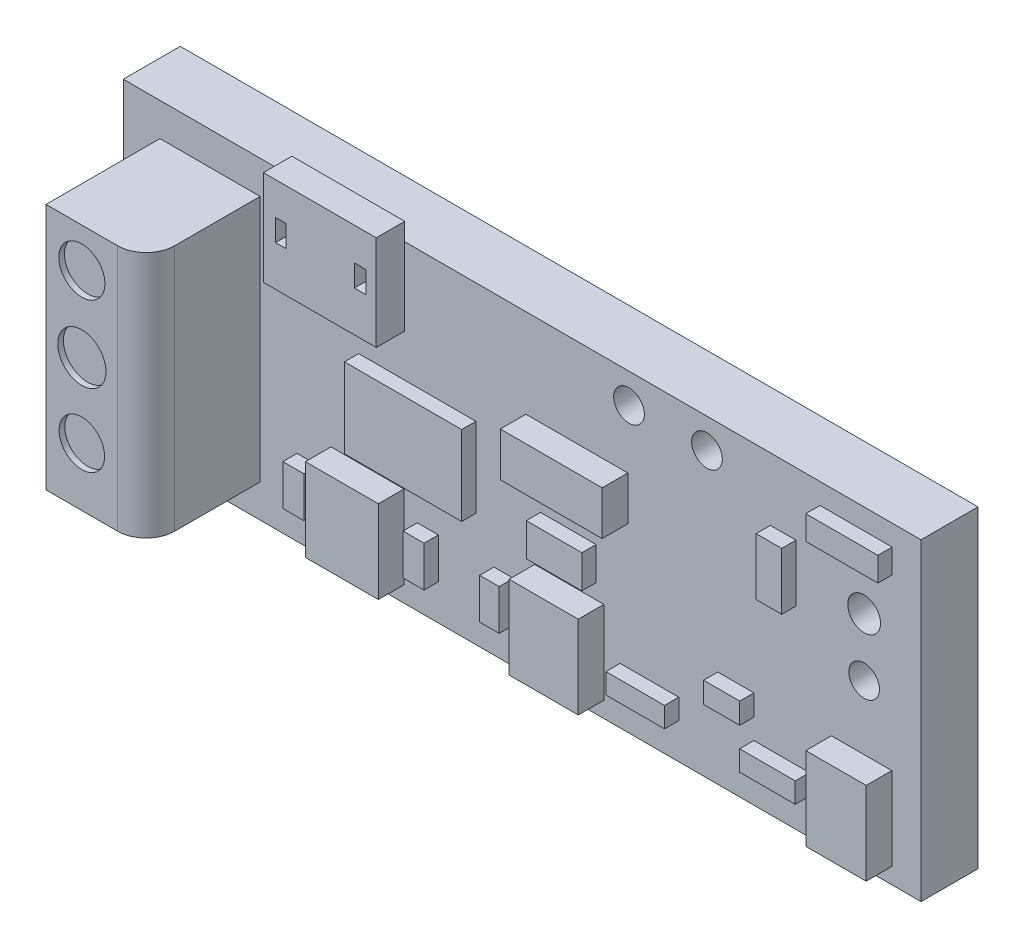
from build123d import *

# Parameters (mm, degrees)
SKETCH_1_W          = 2.8
SKETCH_1_H          = 1.1
EXTRUDE_1_DEPTH     = 0.2
SKETCH_2_W          = 0.351538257
SKETCH_2_H          = 0.867831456
EXTRUDE_2_DEPTH     = 0.4
FILLET_2_R          = 0.1
SKETCH_3_W          = 0.396057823
SKETCH_3_H          = 0.333522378
EXTRUDE_3_DEPTH     = 0.1
SKETCH_4_W          = 0.036503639
SKETCH_4_H          = 0.076483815
SKETCH_4_W_2        = 0.041718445
CUT_EXTRUDE_1_DEPTH = 0.05
SKETCH_5_W          = 0.073840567
SKETCH_5_H          = 0.142406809
SKETCH_5_W_2        = 0.073840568
SKETCH_5_W_3        = 0.068566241
SKETCH_5_W_4        = 0.205698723
SKETCH_5_H_2        = 0.071203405
SKETCH_5_W_5        = 0.195150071
SKETCH_5_W_6        = 0.126583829
SKETCH_5_H_3        = 0.073840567
SKETCH_5_W_7        = 0.089663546
SKETCH_5_H_4        = 0.200424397
SKETCH_5_W_8        = 0.25316766
SKETCH_5_H_5        = 0.08438922
SKETCH_5_H_6        = 0.116035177
SKETCH_5_W_9        = 0.411397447
SKETCH_5_H_7        = 0.279539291
EXTRUDE_4_DEPTH     = 0.05
SKETCH_6_W          = 0.255949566
SKETCH_6_H          = 0.291252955
SKETCH_6_W_2        = 0.242710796
SKETCH_6_W_3        = 0.211820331
SKETCH_6_W_4        = 0.357446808
SKETCH_6_H_2        = 0.154452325
EXTRUDE_5_DEPTH     = 0.09
SKETCH_7_R          = 0.053866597
SKETCH_7_R_2        = 0.057537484
CUT_EXTRUDE_2_DEPTH = 0.2
SKETCH_8_R          = 0.080990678
SKETCH_8_R_2        = 0.084635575
SKETCH_8_R_3        = 0.079956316
CUT_EXTRUDE_3_DEPTH = 0.02


with BuildPart() as part:
    # Sketch 1 → Extrude 1 (new body)
    with BuildSketch(Plane.XY):
        with Locations((-15.251559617, 33.115856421)):
            Rectangle(SKETCH_1_W, SKETCH_1_H)
    extrude(amount=EXTRUDE_1_DEPTH)

    # Sketch 2 → Extrude 2 (add)
    with BuildSketch(Plane.XY.offset(0.2)):
        with Locations((-16.347045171, 33.115856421)):
            Rectangle(SKETCH_2_W, SKETCH_2_H)
    extrude(amount=EXTRUDE_2_DEPTH)

    # Fillet 2
    fillet_2_edges = [part.edges().sort_by_distance(p)[0] for p in [
        (-16.171276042, 33.115856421, 0.6),
    ]]
    fillet(fillet_2_edges, radius=FILLET_2_R)

    # Sketch 3 → Extrude 3 (add)
    with BuildSketch(Plane.XY.offset(0.2)):
        with Locations((-15.861721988, 33.561094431)):
            Rectangle(SKETCH_3_W, SKETCH_3_H)
    extrude(amount=EXTRUDE_3_DEPTH)

    # Sketch 4 → Cut-Extrude 1 (cut)
    with BuildSketch(Plane.XY.offset(0.3)):
        with Locations((-15.998702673, 33.574781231)):
            Rectangle(SKETCH_4_W, SKETCH_4_H)
        with Locations((-15.719710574, 33.574781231)):
            Rectangle(SKETCH_4_W_2, SKETCH_4_H)
    extrude(amount=-CUT_EXTRUDE_1_DEPTH, mode=Mode.SUBTRACT)

    # Sketch 5 → Extrude 4 (add)
    with BuildSketch(Plane.XY.offset(0.2)):
        with Locations((-16.004636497, 32.762275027)):
            Rectangle(SKETCH_5_W, SKETCH_5_H)
        with Locations((-15.582690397, 32.762275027)):
            Rectangle(SKETCH_5_W_2, SKETCH_5_H)
        with Locations((-15.316336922, 32.762275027)):
            Rectangle(SKETCH_5_W_3, SKETCH_5_H)
        with Locations((-14.804727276, 32.726673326)):
            Rectangle(SKETCH_5_W_4, SKETCH_5_H_2)
        with Locations((-14.340586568, 32.726673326)):
            Rectangle(SKETCH_5_W_5, SKETCH_5_H_2)
        with Locations((-14.501453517, 32.870398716)):
            Rectangle(SKETCH_5_W_6, SKETCH_5_H_3)
        with Locations((-14.335312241, 33.345088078)):
            Rectangle(SKETCH_5_W_7, SKETCH_5_H_4)
        with Locations((-14.079507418, 33.550786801)):
            Rectangle(SKETCH_5_W_8, SKETCH_5_H_5)
        with Locations((-15.089540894, 33.023354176)):
            Rectangle(SKETCH_5_W_5, SKETCH_5_H_6)
        with Locations((-15.619610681, 33.105106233)):
            Rectangle(SKETCH_5_W_9, SKETCH_5_H_7)
    extrude(amount=EXTRUDE_4_DEPTH)

    # Sketch 6 → Extrude 5 (add)
    with BuildSketch(Plane.XY.offset(0.2)):
        with Locations((-15.794349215, 32.767344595)):
            Rectangle(SKETCH_6_W, SKETCH_6_H)
        with Locations((-15.086074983, 32.767344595)):
            Rectangle(SKETCH_6_W_2, SKETCH_6_H)
        with Locations((-14.060070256, 32.767344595)):
            Rectangle(SKETCH_6_W_3, SKETCH_6_H)
        with Locations((-15.059597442, 33.277037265)):
            Rectangle(SKETCH_6_W_4, SKETCH_6_H_2)
    extrude(amount=EXTRUDE_5_DEPTH)

    # Sketch 7 → Cut-Extrude 2 (cut)
    with BuildSketch(Plane.XY.offset(0.2)):
        with Locations((-14.876461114, 33.561670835)):
            Circle(SKETCH_7_R)
        with Locations((-14.602859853, 33.561670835)):
            Circle(SKETCH_7_R)
        with Locations((-14.051244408, 33.341024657)):
            Circle(SKETCH_7_R_2)
        with Locations((-14.051244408, 33.138030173)):
            Circle(SKETCH_7_R)
    extrude(amount=-CUT_EXTRUDE_2_DEPTH, mode=Mode.SUBTRACT)

    # Sketch 8 → Cut-Extrude 3 (cut)
    with BuildSketch(Plane.XY.offset(0.6)):
        with Locations((-16.397045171, 33.411631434)):
            Circle(SKETCH_8_R)
        with Locations((-16.397045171, 33.146856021)):
            Circle(SKETCH_8_R_2)
        with Locations((-16.397045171, 32.88649353)):
            Circle(SKETCH_8_R_3)
    extrude(amount=-CUT_EXTRUDE_3_DEPTH, mode=Mode.SUBTRACT)


solid = part.part
